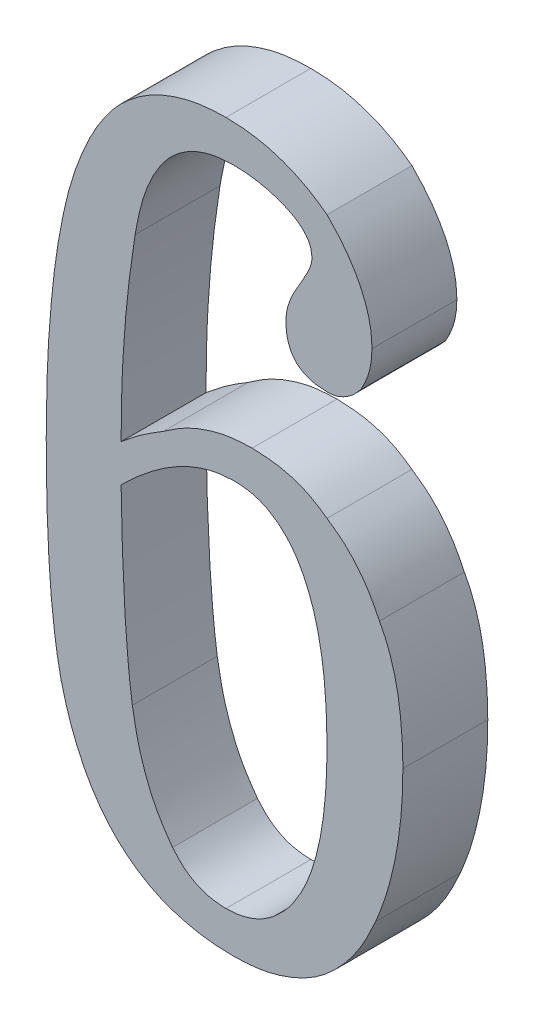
from build123d import *

# Parameters (mm, degrees)
EXTRUDE_1_DEPTH = 3


with BuildPart() as part:
    # Sketch 1 → Extrude 1 (new body)
    with BuildSketch(Plane.XY):
        with BuildLine():
            add(Edge.make_bspline(
                [(8.862433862, 22.619047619), (8.634121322, 22.60910589), (8.192479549, 22.58987487), (7.564606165, 22.402150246), (7.00952772, 22.09278141), (6.525854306, 21.658917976), (6.131929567, 21.096596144), (5.800027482, 20.423397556), (5.549591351, 19.627822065), (5.444447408, 19.052330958), (5.38898687, 18.74877523)],
                knots=[0, 0, 0, 0, 0.951610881, 1.840771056, 2.707972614, 3.587082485, 4.529852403, 5.557819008, 6.711816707, 8, 8, 8, 8], degree=3))
            add(Edge.make_bspline(
                [(5.38898687, 18.74877523), (5.312573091, 18.236580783), (5.156495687, 17.19040849), (5.004985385, 15.578271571), (4.908993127, 13.896612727), (4.899180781, 12.752441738), (4.894179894, 12.169312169)],
                knots=[0, 0, 0, 0, 0.940716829, 1.921441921, 2.940657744, 4, 4, 4, 4], degree=3))
            add(Edge.make_bspline(
                [(4.894179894, 12.169312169), (5.13016738, 12.362834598), (5.602196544, 12.749923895), (6.123045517, 13.0683046), (6.383499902, 13.227513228)],
                knots=[0, 0, 0, 0, 0.999885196, 2, 2, 2, 2], degree=3))
            add(Edge.make_bspline(
                [(6.383499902, 13.227513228), (6.621802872, 13.391580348), (7.089063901, 13.713280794), (7.870410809, 14.038690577), (8.682621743, 14.253320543), (9.241535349, 14.274844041), (9.523809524, 14.285714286)],
                knots=[0, 0, 0, 0, 1.027337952, 2.014389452, 2.99718566, 4, 4, 4, 4], degree=3))
            add(Edge.make_bspline(
                [(9.523809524, 14.285714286), (9.777751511, 14.275275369), (10.269219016, 14.255072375), (10.973583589, 14.10206339), (11.616066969, 13.843964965), (11.98569699, 13.58594325), (12.169312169, 13.457769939)],
                knots=[0, 0, 0, 0, 1.079049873, 2.088342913, 3.050376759, 4, 4, 4, 4], degree=3))
            add(Edge.make_bspline(
                [(12.169312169, 13.457769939), (12.362258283, 13.323490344), (12.749994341, 13.053647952), (13.244967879, 12.529600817), (13.684473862, 11.929483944), (13.907029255, 11.475966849), (14.021164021, 11.243386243)],
                knots=[0, 0, 0, 0, 0.961576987, 1.932342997, 2.939627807, 4, 4, 4, 4], degree=3))
            add(Edge.make_bspline(
                [(14.021164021, 11.243386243), (14.089244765, 11.117306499), (14.22914866, 10.858216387), (14.390843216, 10.433707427), (14.534103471, 9.975849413), (14.651304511, 9.481609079), (14.737798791, 8.949313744), (14.800738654, 8.380273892), (14.84012551, 7.773751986), (14.846061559, 7.356844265), (14.849108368, 7.142857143)],
                knots=[0, 0, 0, 0, 0.812712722, 1.670100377, 2.573284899, 3.535766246, 4.550884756, 5.633094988, 6.785133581, 8, 8, 8, 8], degree=3))
            add(Edge.make_bspline(
                [(14.849108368, 7.142857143), (14.84615355, 6.904387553), (14.840299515, 6.431935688), (14.79774682, 5.733451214), (14.716246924, 5.057436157), (14.61672617, 4.40072004), (14.477001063, 3.767457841), (14.317736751, 3.151103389), (14.121648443, 2.557505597), (13.966122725, 2.174384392), (13.888888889, 1.984126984)],
                knots=[0, 0, 0, 0, 1.083407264, 2.146427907, 3.177112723, 4.176068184, 5.162659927, 6.121811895, 7.067294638, 8, 8, 8, 8], degree=3))
            add(Edge.make_bspline(
                [(13.888888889, 1.984126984), (13.7583809, 1.701443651), (13.507029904, 1.157011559), (13.033775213, 0.42110356), (12.489383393, -0.194463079), (11.89329552, -0.713521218), (11.220424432, -1.10178756), (10.49025615, -1.383230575), (9.697237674, -1.561506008), (9.145916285, -1.578541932), (8.862433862, -1.587301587)],
                knots=[0, 0, 0, 0, 1.13441373, 2.184816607, 3.176269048, 4.122433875, 5.053793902, 5.992585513, 6.967813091, 8, 8, 8, 8], degree=3))
            add(Edge.make_bspline(
                [(8.862433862, -1.587301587), (8.66629798, -1.584049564), (8.282729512, -1.577689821), (7.722025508, -1.51304572), (7.189883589, -1.404350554), (6.684856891, -1.257920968), (6.203608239, -1.072473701), (5.754153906, -0.835416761), (5.330397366, -0.560610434), (4.935212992, -0.24364697), (4.566085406, 0.114275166), (4.229396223, 0.519665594), (3.912991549, 0.96132697), (3.630299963, 1.447967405), (3.37528484, 1.976063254), (3.144464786, 2.544976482), (2.944844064, 3.158078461), (2.834319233, 3.583864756), (2.777777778, 3.801685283)],
                knots=[0, 0, 0, 0, 1.057975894, 2.069005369, 3.040198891, 3.985504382, 4.903473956, 5.817841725, 6.722133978, 7.624879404, 8.547110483, 9.491429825, 10.464540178, 11.475569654, 12.523850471, 13.626705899, 14.785888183, 16, 16, 16, 16], degree=3))
            add(Edge.make_bspline(
                [(2.777777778, 3.801685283), (2.735051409, 4.007101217), (2.644201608, 4.44388059), (2.540984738, 5.144158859), (2.446507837, 5.923135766), (2.376539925, 6.781291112), (2.316205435, 7.717047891), (2.279914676, 8.733198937), (2.254757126, 9.829059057), (2.250749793, 10.586893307), (2.248677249, 10.978835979)],
                knots=[0, 0, 0, 0, 0.69836563, 1.48494665, 2.355516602, 3.310410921, 4.350849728, 5.477066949, 6.69516966, 8, 8, 8, 8], degree=3))
            add(Edge.make_bspline(
                [(2.248677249, 10.978835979), (2.252336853, 11.378941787), (2.259493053, 12.161331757), (2.290699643, 13.303359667), (2.355348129, 14.386381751), (2.444053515, 15.407126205), (2.548454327, 16.37189796), (2.685695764, 17.273758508), (2.845342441, 18.11767), (2.977932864, 18.654581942), (3.042328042, 18.915343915)],
                knots=[0, 0, 0, 0, 1.200905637, 2.348320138, 3.428484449, 4.456645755, 5.423330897, 6.340395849, 7.193980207, 8, 8, 8, 8], degree=3))
            add(Edge.make_bspline(
                [(3.042328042, 18.915343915), (3.103378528, 19.128478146), (3.222343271, 19.543797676), (3.44000721, 20.136477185), (3.674190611, 20.686612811), (3.927368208, 21.191868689), (4.202657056, 21.650518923), (4.497652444, 22.06297312), (4.808200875, 22.436475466), (5.043428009, 22.647757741), (5.158730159, 22.751322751)],
                knots=[0, 0, 0, 0, 1.197274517, 2.333043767, 3.407951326, 4.425780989, 5.383420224, 6.294034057, 7.163780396, 8, 8, 8, 8], degree=3))
            add(Edge.make_bspline(
                [(5.158730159, 22.751322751), (5.276083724, 22.846940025), (5.509081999, 23.03678223), (5.891786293, 23.276744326), (6.292518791, 23.483966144), (6.715706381, 23.648299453), (7.155238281, 23.784157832), (7.61813517, 23.876017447), (8.10180811, 23.929493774), (8.431180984, 23.937663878), (8.597883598, 23.941798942)],
                knots=[0, 0, 0, 0, 0.976092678, 1.93797188, 2.908930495, 3.883542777, 4.863723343, 5.874420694, 6.924199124, 8, 8, 8, 8], degree=3))
            add(Edge.make_bspline(
                [(8.597883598, 23.941798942), (8.764600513, 23.937783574), (9.092378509, 23.929889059), (9.577430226, 23.874728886), (10.046773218, 23.783638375), (10.500848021, 23.64760085), (10.943256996, 23.483199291), (11.368355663, 23.276096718), (11.780595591, 23.034883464), (12.038569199, 22.846697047), (12.169312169, 22.751322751)],
                knots=[0, 0, 0, 0, 1.043370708, 2.051345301, 3.051620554, 4.031637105, 5.01500597, 6.00245665, 6.98762996, 8, 8, 8, 8], degree=3))
            add(Edge.make_bspline(
                [(12.169312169, 22.751322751), (12.295723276, 22.621129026), (12.542821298, 22.366637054), (12.864765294, 21.960634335), (13.136079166, 21.549663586), (13.365997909, 21.139642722), (13.534796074, 20.719824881), (13.667971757, 20.300372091), (13.741654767, 19.873277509), (13.751649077, 19.586768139), (13.756613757, 19.444444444)],
                knots=[0, 0, 0, 0, 1.155957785, 2.259571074, 3.295814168, 4.292525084, 5.249202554, 6.174280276, 7.093072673, 8, 8, 8, 8], degree=3))
            add(Edge.make_bspline(
                [(13.756613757, 19.444444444), (13.751960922, 19.315090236), (13.742754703, 19.059146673), (13.667332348, 18.6826306), (13.540242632, 18.323479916), (13.419908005, 18.100713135), (13.35978836, 17.989417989)],
                knots=[0, 0, 0, 0, 1.016523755, 2.011320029, 3.006447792, 4, 4, 4, 4], degree=3))
            add(Edge.make_bspline(
                [(13.35978836, 17.989417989), (13.27215151, 17.888915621), (13.10649053, 17.698934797), (12.809657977, 17.489886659), (12.498259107, 17.347779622), (12.278551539, 17.334596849), (12.169312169, 17.328042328)],
                knots=[0, 0, 0, 0, 1.1318292, 2.139510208, 3.074957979, 4, 4, 4, 4], degree=3))
            add(Edge.make_bspline(
                [(12.169312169, 17.328042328), (12.05460656, 17.332416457), (11.839197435, 17.340630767), (11.538279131, 17.409466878), (11.282273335, 17.522477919), (11.067747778, 17.681504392), (10.908721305, 17.896029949), (10.795710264, 18.152035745), (10.726874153, 18.452954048), (10.718659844, 18.668363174), (10.714285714, 18.783068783)],
                knots=[0, 0, 0, 0, 1.167023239, 2.191588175, 3.121942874, 4, 4.878057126, 5.808411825, 6.832976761, 8, 8, 8, 8], degree=3))
            add(Edge.make_bspline(
                [(10.714285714, 18.783068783), (10.722106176, 18.888178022), (10.73876981, 19.112142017), (10.844137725, 19.457563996), (11.014569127, 19.827195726), (11.163917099, 20.073004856), (11.243386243, 20.203801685)],
                knots=[0, 0, 0, 0, 0.822301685, 1.752138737, 2.803896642, 4, 4, 4, 4], degree=3))
            add(Edge.make_bspline(
                [(11.243386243, 20.203801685), (11.301711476, 20.306100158), (11.408540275, 20.493470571), (11.537077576, 20.754748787), (11.62014354, 20.973042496), (11.63415762, 21.106407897), (11.64021164, 21.164021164)],
                knots=[0, 0, 0, 0, 1.348070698, 2.469133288, 3.338672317, 4, 4, 4, 4], degree=3))
            add(Edge.make_bspline(
                [(11.64021164, 21.164021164), (11.626962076, 21.283302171), (11.5998497, 21.527385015), (11.363873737, 21.850029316), (11.009651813, 22.125295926), (10.711998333, 22.250887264), (10.547717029, 22.320203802)],
                knots=[0, 0, 0, 0, 0.839015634, 1.71686447, 2.739888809, 4, 4, 4, 4], degree=3))
            add(Edge.make_bspline(
                [(10.547717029, 22.320203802), (10.414644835, 22.367126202), (10.147318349, 22.461387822), (9.729582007, 22.551712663), (9.29995604, 22.607051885), (9.009579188, 22.615013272), (8.862433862, 22.619047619)],
                knots=[0, 0, 0, 0, 0.983238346, 1.975210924, 2.973960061, 4, 4, 4, 4], degree=3))
        make_face()
        with BuildLine():
            add(Edge.make_bspline(
                [(8.862433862, 12.962962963), (8.706834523, 12.955701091), (8.389456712, 12.940888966), (7.909965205, 12.838023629), (7.424358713, 12.669392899), (6.929502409, 12.434452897), (6.427335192, 12.136483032), (5.919475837, 11.766788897), (5.400756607, 11.338009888), (5.066701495, 11.013930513), (4.894179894, 10.846560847)],
                knots=[0, 0, 0, 0, 0.809918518, 1.652000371, 2.541995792, 3.481463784, 4.499269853, 5.577601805, 6.748960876, 8, 8, 8, 8], degree=3))
            add(Edge.make_bspline(
                [(4.894179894, 10.846560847), (4.899939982, 10.497077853), (4.911111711, 9.819253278), (4.939960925, 8.836064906), (4.980638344, 7.91838641), (5.022620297, 7.067327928), (5.075872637, 6.281630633), (5.140824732, 5.563275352), (5.206092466, 4.909332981), (5.263655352, 4.497205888), (5.291005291, 4.301391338)],
                knots=[0, 0, 0, 0, 1.278523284, 2.479704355, 3.597745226, 4.63850007, 5.596494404, 6.478005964, 7.276852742, 8, 8, 8, 8], degree=3))
            add(Edge.make_bspline(
                [(5.291005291, 4.301391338), (5.354176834, 3.941665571), (5.475570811, 3.250396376), (5.791097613, 2.281528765), (6.183487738, 1.409994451), (6.538777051, 0.906490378), (6.711738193, 0.661375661)],
                knots=[0, 0, 0, 0, 1.10878528, 2.130703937, 3.089993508, 4, 4, 4, 4], degree=3))
            add(Edge.make_bspline(
                [(6.711738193, 0.661375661), (6.836157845, 0.518969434), (7.07763073, 0.242588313), (7.53838095, -0.0512016), (8.050601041, -0.233341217), (8.411774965, -0.253937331), (8.597883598, -0.264550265)],
                knots=[0, 0, 0, 0, 1.037935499, 2.01441876, 2.976853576, 4, 4, 4, 4], degree=3))
            add(Edge.make_bspline(
                [(8.597883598, -0.264550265), (8.75379165, -0.257078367), (9.060027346, -0.242402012), (9.502280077, -0.124290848), (9.917705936, 0.061068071), (10.160386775, 0.24173314), (10.283166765, 0.33313737)],
                knots=[0, 0, 0, 0, 1.02505848, 2.013427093, 2.994929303, 4, 4, 4, 4], degree=3))
            add(Edge.make_bspline(
                [(10.283166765, 0.33313737), (10.435617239, 0.473535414), (10.748524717, 0.761705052), (11.126875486, 1.306113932), (11.459447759, 1.932522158), (11.717622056, 2.658541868), (11.923580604, 3.473701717), (12.065914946, 4.38218491), (12.15439774, 5.383958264), (12.164201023, 6.082821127), (12.169312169, 6.447187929)],
                knots=[0, 0, 0, 0, 0.752554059, 1.544631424, 2.398352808, 3.329455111, 4.341755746, 5.456052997, 6.673659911, 8, 8, 8, 8], degree=3))
            add(Edge.make_bspline(
                [(12.169312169, 6.447187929), (12.163133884, 6.817995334), (12.151306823, 7.527830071), (12.077464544, 8.541463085), (11.940952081, 9.451933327), (11.755560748, 10.261023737), (11.505529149, 10.965775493), (11.209108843, 11.572598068), (10.853498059, 12.081851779), (10.557931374, 12.342500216), (10.415441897, 12.468155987)],
                knots=[0, 0, 0, 0, 1.377052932, 2.636085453, 3.770738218, 4.793000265, 5.713680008, 6.540837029, 7.296553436, 8, 8, 8, 8], degree=3))
            add(Edge.make_bspline(
                [(10.415441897, 12.468155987), (10.306769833, 12.544119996), (10.088691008, 12.696561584), (9.712666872, 12.853180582), (9.300029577, 12.948919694), (9.011597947, 12.958176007), (8.862433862, 12.962962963)],
                knots=[0, 0, 0, 0, 0.956018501, 1.91850034, 2.923540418, 4, 4, 4, 4], degree=3))
        make_face(mode=Mode.SUBTRACT)
    extrude(amount=EXTRUDE_1_DEPTH)


solid = part.part
